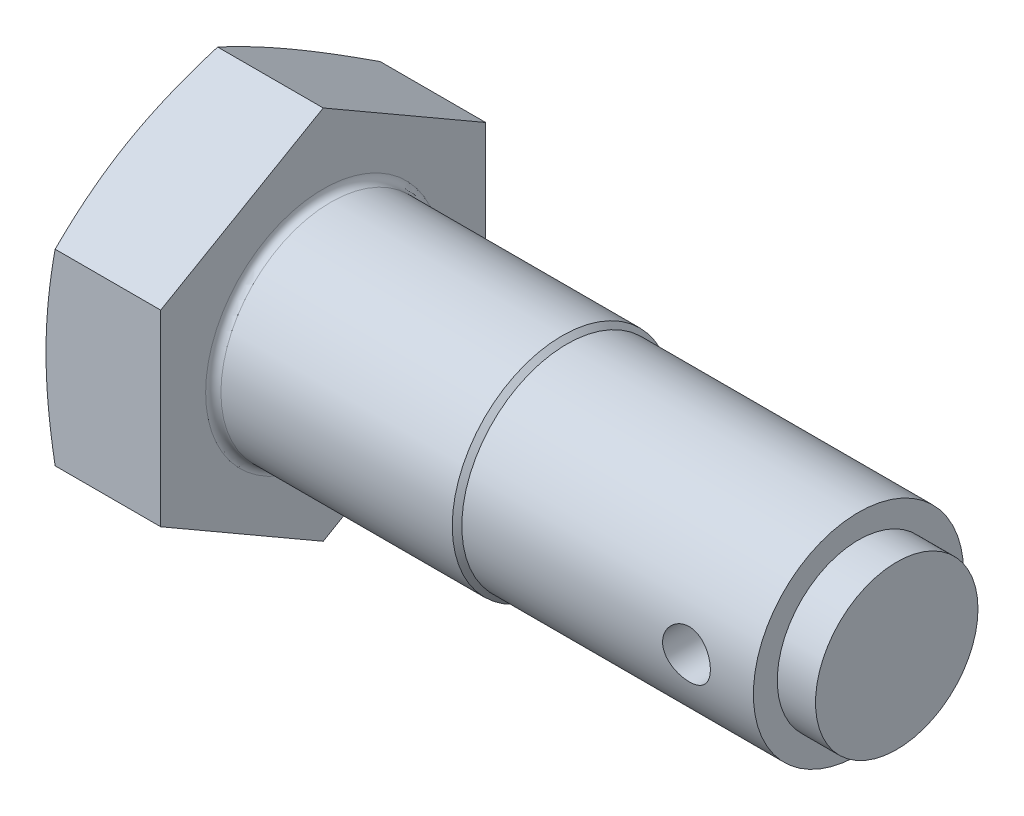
ISO-10303-21;
HEADER;
FILE_DESCRIPTION(('STEP AP214'),'2;1');
FILE_NAME('part.step','',(''),(''),'','','');
FILE_SCHEMA(('AUTOMOTIVE_DESIGN { 1 0 10303 214 1 1 1 1 }'));
ENDSEC;
DATA;
#1=APPLICATION_CONTEXT('core data for automotive mechanical design processes');
#2=APPLICATION_PROTOCOL_DEFINITION('international standard','automotive_design',2000,#1);
#3=PRODUCT_CONTEXT('',#1,'mechanical');
#4=PRODUCT('Part','Part','',(#3));
#5=PRODUCT_RELATED_PRODUCT_CATEGORY('part','',(#4));
#6=PRODUCT_DEFINITION_FORMATION('','',#4);
#7=PRODUCT_DEFINITION_CONTEXT('part definition',#1,'design');
#8=PRODUCT_DEFINITION('design','',#6,#7);
#9=PRODUCT_DEFINITION_SHAPE('','',#8);
#10=(LENGTH_UNIT() NAMED_UNIT(*) SI_UNIT(.MILLI.,.METRE.));
#11=(NAMED_UNIT(*) PLANE_ANGLE_UNIT() SI_UNIT($,.RADIAN.));
#12=(NAMED_UNIT(*) SI_UNIT($,.STERADIAN.) SOLID_ANGLE_UNIT());
#13=UNCERTAINTY_MEASURE_WITH_UNIT(LENGTH_MEASURE(1.E-05),#10,'distance_accuracy_value','');
#14=(GEOMETRIC_REPRESENTATION_CONTEXT(3) GLOBAL_UNCERTAINTY_ASSIGNED_CONTEXT((#13)) GLOBAL_UNIT_ASSIGNED_CONTEXT((#10,
#11,#12)) REPRESENTATION_CONTEXT('',''));
#15=CARTESIAN_POINT('',(0.,0.,0.));
#16=DIRECTION('',(0.,0.,1.));
#17=DIRECTION('',(1.,0.,0.));
#18=AXIS2_PLACEMENT_3D('',#15,#16,#17);
#19=CARTESIAN_POINT('',(12.,-9.81495457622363,17.));
#20=DIRECTION('',(0.,0.866025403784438,-0.5));
#21=DIRECTION('',(0.,0.5,0.866025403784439));
#22=AXIS2_PLACEMENT_3D('',#19,#20,#21);
#23=PLANE('',#22);
#24=CARTESIAN_POINT('',(0.95725067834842,-19.6300246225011,-0.000199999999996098));
#25=CARTESIAN_POINT('',(0.883274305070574,-19.4267620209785,0.351861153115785));
#26=CARTESIAN_POINT('',(0.8126248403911,-19.2232006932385,0.704439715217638));
#27=CARTESIAN_POINT('',(0.678711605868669,-18.8154528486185,1.41067969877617));
#28=CARTESIAN_POINT('',(0.615448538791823,-18.611266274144,1.76434121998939));
#29=CARTESIAN_POINT('',(0.437775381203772,-17.9975024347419,2.82741137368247));
#30=CARTESIAN_POINT('',(0.335585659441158,-17.5870020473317,3.5384189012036));
#31=CARTESIAN_POINT('',(0.211392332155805,-16.9717666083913,4.60403794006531));
#32=CARTESIAN_POINT('',(0.174948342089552,-16.7677413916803,4.95741998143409));
#33=CARTESIAN_POINT('',(0.112012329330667,-16.3593100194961,5.66484386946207));
#34=CARTESIAN_POINT('',(0.0855199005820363,-16.154903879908,6.01888568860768));
#35=CARTESIAN_POINT('',(0.0429497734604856,-15.7458903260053,6.72731794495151));
#36=CARTESIAN_POINT('',(0.0268685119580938,-15.5412830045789,7.08170822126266));
#37=CARTESIAN_POINT('',(0.00539364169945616,-15.1319277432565,7.79073233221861));
#38=CARTESIAN_POINT('',(0.,-14.927179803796,8.14536616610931));
#39=CARTESIAN_POINT('',(0.,-14.5176839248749,8.85463383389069));
#40=CARTESIAN_POINT('',(0.00539364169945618,-14.3129359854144,9.20926766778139));
#41=CARTESIAN_POINT('',(0.0268685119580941,-13.903580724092,9.91829177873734));
#42=CARTESIAN_POINT('',(0.0429497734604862,-13.6989734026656,10.2726820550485));
#43=CARTESIAN_POINT('',(0.0855199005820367,-13.2899598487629,10.9811143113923));
#44=CARTESIAN_POINT('',(0.112012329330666,-13.0855537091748,11.3351561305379));
#45=CARTESIAN_POINT('',(0.174948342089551,-12.6771223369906,12.0425800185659));
#46=CARTESIAN_POINT('',(0.211392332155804,-12.4730971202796,12.3959620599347));
#47=CARTESIAN_POINT('',(0.335585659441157,-11.8578616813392,13.4615810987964));
#48=CARTESIAN_POINT('',(0.437775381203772,-11.447361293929,14.1725886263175));
#49=CARTESIAN_POINT('',(0.615448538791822,-10.8335974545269,15.2356587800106));
#50=CARTESIAN_POINT('',(0.678711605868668,-10.6294108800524,15.5893203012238));
#51=CARTESIAN_POINT('',(0.812624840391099,-10.2216630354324,16.2955602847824));
#52=CARTESIAN_POINT('',(0.883274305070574,-10.0181017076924,16.6481388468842));
#53=CARTESIAN_POINT('',(0.957250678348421,-9.8148391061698,17.0002));
#54=B_SPLINE_CURVE_WITH_KNOTS('',3,(#24,#25,#26,#27,#28,#29,#30,#31,#32,#33,#34,#35,#36,#37,#38,
#39,#40,#41,#42,#43,#44,#45,#46,#47,#48,#49,#50,#51,#52,#53),.UNSPECIFIED.,.F.,.F.,(4,2,2,2,2,2,
2,2,2,2,2,2,2,2,4),(0.,1.23956682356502,2.47925148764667,4.96033455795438,6.18926159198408,
7.41813847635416,8.64659456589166,9.87504686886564,11.1034991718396,12.3319552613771,
13.5608321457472,14.7897591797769,17.2708422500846,18.5105269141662,19.7500937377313),.UNSPECIFIED.);
#55=CARTESIAN_POINT('',(0.957208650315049,-19.6299091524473,0.));
#56=VERTEX_POINT('',#55);
#57=CARTESIAN_POINT('',(0.,-14.7224318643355,8.5));
#58=VERTEX_POINT('',#57);
#59=EDGE_CURVE('E273',#56,#58,#54,.T.);
#60=ORIENTED_EDGE('',*,*,#59,.F.);
#61=DIRECTION('',(-1.,0.,0.));
#62=VECTOR('',#61,1.);
#63=CARTESIAN_POINT('',(12.,-19.6299091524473,0.));
#64=LINE('',#63,#62);
#65=CARTESIAN_POINT('',(12.,-19.6299091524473,0.));
#66=VERTEX_POINT('',#65);
#67=EDGE_CURVE('E151',#66,#56,#64,.T.);
#68=ORIENTED_EDGE('',*,*,#67,.F.);
#69=DIRECTION('',(0.,-0.5,-0.866025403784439));
#70=VECTOR('',#69,1.);
#71=CARTESIAN_POINT('',(12.,-9.81495457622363,17.));
#72=LINE('',#71,#70);
#73=CARTESIAN_POINT('',(12.,-9.81495457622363,17.));
#74=VERTEX_POINT('',#73);
#75=EDGE_CURVE('E283',#74,#66,#72,.T.);
#76=ORIENTED_EDGE('',*,*,#75,.F.);
#77=DIRECTION('',(-1.,0.,0.));
#78=VECTOR('',#77,1.);
#79=CARTESIAN_POINT('',(12.,-9.81495457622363,17.));
#80=LINE('',#79,#78);
#81=CARTESIAN_POINT('',(0.957208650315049,-9.81495457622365,17.));
#82=VERTEX_POINT('',#81);
#83=EDGE_CURVE('E138',#74,#82,#80,.T.);
#84=ORIENTED_EDGE('',*,*,#83,.T.);
#85=EDGE_CURVE('E134',#58,#82,#54,.T.);
#86=ORIENTED_EDGE('',*,*,#85,.F.);
#87=EDGE_LOOP('',(#60,#68,#76,#84,#86));
#88=FACE_BOUND('',#87,.T.);
#89=ADVANCED_FACE('F35',(#88),#23,.F.);
#90=CARTESIAN_POINT('',(12.,-19.6299091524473,0.));
#91=DIRECTION('',(0.,0.866025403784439,0.5));
#92=DIRECTION('',(0.,-0.5,0.866025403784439));
#93=AXIS2_PLACEMENT_3D('',#90,#91,#92);
#94=PLANE('',#93);
#95=CARTESIAN_POINT('',(0.957250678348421,-9.8148391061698,-17.0002));
#96=CARTESIAN_POINT('',(0.883274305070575,-10.0181017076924,-16.6481388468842));
#97=CARTESIAN_POINT('',(0.812624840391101,-10.2216630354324,-16.2955602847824));
#98=CARTESIAN_POINT('',(0.678711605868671,-10.6294108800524,-15.5893203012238));
#99=CARTESIAN_POINT('',(0.615448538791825,-10.8335974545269,-15.2356587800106));
#100=CARTESIAN_POINT('',(0.437775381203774,-11.447361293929,-14.1725886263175));
#101=CARTESIAN_POINT('',(0.335585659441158,-11.8578616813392,-13.4615810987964));
#102=CARTESIAN_POINT('',(0.211392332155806,-12.4730971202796,-12.3959620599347));
#103=CARTESIAN_POINT('',(0.174948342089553,-12.6771223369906,-12.0425800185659));
#104=CARTESIAN_POINT('',(0.112012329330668,-13.0855537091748,-11.3351561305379));
#105=CARTESIAN_POINT('',(0.0855199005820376,-13.2899598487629,-10.9811143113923));
#106=CARTESIAN_POINT('',(0.0429497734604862,-13.6989734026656,-10.2726820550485));
#107=CARTESIAN_POINT('',(0.0268685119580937,-13.903580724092,-9.91829177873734));
#108=CARTESIAN_POINT('',(0.00539364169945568,-14.3129359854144,-9.20926766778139));
#109=CARTESIAN_POINT('',(0.,-14.5176839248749,-8.8546338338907));
#110=CARTESIAN_POINT('',(0.,-14.927179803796,-8.14536616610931));
#111=CARTESIAN_POINT('',(0.00539364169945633,-15.1319277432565,-7.79073233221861));
#112=CARTESIAN_POINT('',(0.026868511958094,-15.5412830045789,-7.08170822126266));
#113=CARTESIAN_POINT('',(0.0429497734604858,-15.7458903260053,-6.72731794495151));
#114=CARTESIAN_POINT('',(0.0855199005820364,-16.154903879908,-6.01888568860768));
#115=CARTESIAN_POINT('',(0.112012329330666,-16.3593100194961,-5.66484386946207));
#116=CARTESIAN_POINT('',(0.174948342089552,-16.7677413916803,-4.95741998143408));
#117=CARTESIAN_POINT('',(0.211392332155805,-16.9717666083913,-4.6040379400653));
#118=CARTESIAN_POINT('',(0.335585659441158,-17.5870020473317,-3.53841890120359));
#119=CARTESIAN_POINT('',(0.437775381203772,-17.9975024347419,-2.82741137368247));
#120=CARTESIAN_POINT('',(0.615448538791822,-18.611266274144,-1.76434121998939));
#121=CARTESIAN_POINT('',(0.678711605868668,-18.8154528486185,-1.41067969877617));
#122=CARTESIAN_POINT('',(0.812624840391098,-19.2232006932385,-0.704439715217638));
#123=CARTESIAN_POINT('',(0.883274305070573,-19.4267620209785,-0.351861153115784));
#124=CARTESIAN_POINT('',(0.957250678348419,-19.6300246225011,0.000199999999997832));
#125=B_SPLINE_CURVE_WITH_KNOTS('',3,(#95,#96,#97,#98,#99,#100,#101,#102,#103,#104,#105,#106,
#107,#108,#109,#110,#111,#112,#113,#114,#115,#116,#117,#118,#119,#120,#121,#122,#123,#124),
.UNSPECIFIED.,.F.,.F.,(4,2,2,2,2,2,2,2,2,2,2,2,2,2,4),(0.,1.23956682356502,2.47925148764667,
4.96033455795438,6.18926159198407,7.41813847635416,8.64659456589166,9.87504686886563,
11.1034991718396,12.3319552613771,13.5608321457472,14.7897591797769,17.2708422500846,
18.5105269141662,19.7500937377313),.UNSPECIFIED.);
#126=CARTESIAN_POINT('',(0.957208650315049,-9.81495457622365,-17.));
#127=VERTEX_POINT('',#126);
#128=CARTESIAN_POINT('',(0.,-14.7224318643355,-8.49999999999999));
#129=VERTEX_POINT('',#128);
#130=EDGE_CURVE('E228',#127,#129,#125,.T.);
#131=ORIENTED_EDGE('',*,*,#130,.F.);
#132=DIRECTION('',(-1.,0.,0.));
#133=VECTOR('',#132,1.);
#134=CARTESIAN_POINT('',(12.,-9.81495457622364,-17.));
#135=LINE('',#134,#133);
#136=CARTESIAN_POINT('',(12.,-9.81495457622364,-17.));
#137=VERTEX_POINT('',#136);
#138=EDGE_CURVE('E148',#137,#127,#135,.T.);
#139=ORIENTED_EDGE('',*,*,#138,.F.);
#140=DIRECTION('',(0.,0.5,-0.866025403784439));
#141=VECTOR('',#140,1.);
#142=CARTESIAN_POINT('',(12.,-19.6299091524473,0.));
#143=LINE('',#142,#141);
#144=EDGE_CURVE('E280',#66,#137,#143,.T.);
#145=ORIENTED_EDGE('',*,*,#144,.F.);
#146=ORIENTED_EDGE('',*,*,#67,.T.);
#147=EDGE_CURVE('E224',#129,#56,#125,.T.);
#148=ORIENTED_EDGE('',*,*,#147,.F.);
#149=EDGE_LOOP('',(#131,#139,#145,#146,#148));
#150=FACE_BOUND('',#149,.T.);
#151=ADVANCED_FACE('F235',(#150),#94,.F.);
#152=CARTESIAN_POINT('',(12.,-9.81495457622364,-17.));
#153=DIRECTION('',(0.,0.,1.));
#154=DIRECTION('',(0.,-1.,0.));
#155=AXIS2_PLACEMENT_3D('',#152,#153,#154);
#156=PLANE('',#155);
#157=CARTESIAN_POINT('',(5.11494433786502,-25.9865515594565,-17.));
#158=CARTESIAN_POINT('',(4.99781404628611,-25.6019864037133,-17.));
#159=CARTESIAN_POINT('',(4.88139210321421,-25.2172056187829,-17.));
#160=CARTESIAN_POINT('',(4.6501234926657,-24.4471686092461,-17.));
#161=CARTESIAN_POINT('',(4.53527683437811,-24.0619123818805,-17.));
#162=CARTESIAN_POINT('',(4.19332284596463,-22.9053140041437,-17.));
#163=CARTESIAN_POINT('',(3.96881886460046,-22.1331989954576,-17.));
#164=CARTESIAN_POINT('',(3.52794140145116,-20.585087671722,-17.));
#165=CARTESIAN_POINT('',(3.31158387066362,-19.8090868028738,-17.));
#166=CARTESIAN_POINT('',(2.88951373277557,-18.2541988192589,-17.));
#167=CARTESIAN_POINT('',(2.6838009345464,-17.4753117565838,-17.));
#168=CARTESIAN_POINT('',(2.28811694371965,-15.923756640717,-17.));
#169=CARTESIAN_POINT('',(2.09798293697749,-15.1511303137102,-17.));
#170=CARTESIAN_POINT('',(1.73390229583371,-13.6020329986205,-17.));
#171=CARTESIAN_POINT('',(1.55995593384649,-12.8255619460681,-17.));
#172=CARTESIAN_POINT('',(1.23230633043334,-11.2686014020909,-17.));
#173=CARTESIAN_POINT('',(1.07859618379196,-10.488113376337,-17.));
#174=CARTESIAN_POINT('',(0.796099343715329,-8.92260605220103,-17.));
#175=CARTESIAN_POINT('',(0.667311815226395,-8.13758690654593,-17.));
#176=CARTESIAN_POINT('',(0.452644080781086,-6.65141371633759,-17.));
#177=CARTESIAN_POINT('',(0.363572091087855,-5.95072503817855,-17.));
#178=CARTESIAN_POINT('',(0.212794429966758,-4.54638482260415,-17.));
#179=CARTESIAN_POINT('',(0.151087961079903,-3.84273337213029,-17.));
#180=CARTESIAN_POINT('',(0.0580129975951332,-2.43389487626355,-17.));
#181=CARTESIAN_POINT('',(0.0266230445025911,-1.72870927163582,-17.));
#182=CARTESIAN_POINT('',(-0.00422961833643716,-0.317632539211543,-17.));
#183=CARTESIAN_POINT('',(-0.00369255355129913,0.388258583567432,-17.));
#184=CARTESIAN_POINT('',(0.0293632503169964,1.80286104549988,-17.));
#185=CARTESIAN_POINT('',(0.0620441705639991,2.51156853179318,-17.));
#186=CARTESIAN_POINT('',(0.157883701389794,3.92690185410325,-17.));
#187=CARTESIAN_POINT('',(0.221043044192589,4.63352763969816,-17.));
#188=CARTESIAN_POINT('',(0.374884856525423,6.04434863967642,-17.));
#189=CARTESIAN_POINT('',(0.465590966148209,6.74854123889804,-17.));
#190=CARTESIAN_POINT('',(0.670847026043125,8.15340353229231,-17.));
#191=CARTESIAN_POINT('',(0.785397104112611,8.85407320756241,-17.));
#192=CARTESIAN_POINT('',(1.04120460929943,10.288760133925,-17.));
#193=CARTESIAN_POINT('',(1.18355422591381,11.022580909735,-17.));
#194=CARTESIAN_POINT('',(1.48657469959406,12.4864541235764,-17.));
#195=CARTESIAN_POINT('',(1.64724693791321,13.2165062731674,-17.));
#196=CARTESIAN_POINT('',(1.98353886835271,14.6733624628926,-17.));
#197=CARTESIAN_POINT('',(2.15916290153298,15.4001654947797,-17.));
#198=CARTESIAN_POINT('',(2.52250153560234,16.8507098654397,-17.));
#199=CARTESIAN_POINT('',(2.71021584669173,17.5744512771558,-17.));
#200=CARTESIAN_POINT('',(3.09572246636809,19.0202310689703,-17.));
#201=CARTESIAN_POINT('',(3.29352740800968,19.7422660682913,-17.));
#202=CARTESIAN_POINT('',(3.69718381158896,21.1840802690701,-17.));
#203=CARTESIAN_POINT('',(3.90303530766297,21.903859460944,-17.));
#204=CARTESIAN_POINT('',(4.32131194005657,23.3413701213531,-17.));
#205=CARTESIAN_POINT('',(4.53373596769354,24.0591019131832,-17.));
#206=CARTESIAN_POINT('',(4.96404894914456,25.4929209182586,-17.));
#207=CARTESIAN_POINT('',(5.18193789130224,26.209008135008,-17.));
#208=CARTESIAN_POINT('',(5.61983797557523,27.6318801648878,-17.));
#209=CARTESIAN_POINT('',(5.83979911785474,28.3386803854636,-17.));
#210=CARTESIAN_POINT('',(6.28347308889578,29.7511031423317,-17.));
#211=CARTESIAN_POINT('',(6.50718592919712,30.4567256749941,-17.));
#212=CARTESIAN_POINT('',(7.18308130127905,32.5721409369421,-17.));
#213=CARTESIAN_POINT('',(7.64000186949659,33.9804205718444,-17.));
#214=CARTESIAN_POINT('',(8.33142797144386,36.0878895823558,-17.));
#215=CARTESIAN_POINT('',(8.56246442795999,36.7882228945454,-17.));
#216=CARTESIAN_POINT('',(9.02653552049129,38.1882282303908,-17.));
#217=CARTESIAN_POINT('',(9.25957015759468,38.8879002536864,-17.));
#218=CARTESIAN_POINT('',(9.72735009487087,40.2866080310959,-17.));
#219=CARTESIAN_POINT('',(9.96209525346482,40.9856438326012,-17.));
#220=CARTESIAN_POINT('',(10.4331045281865,42.3832017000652,-17.));
#221=CARTESIAN_POINT('',(10.6693686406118,43.0817237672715,-17.));
#222=CARTESIAN_POINT('',(10.9062875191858,43.7800232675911,-17.));
#223=B_SPLINE_CURVE_WITH_KNOTS('',3,(#157,#158,#159,#160,#161,#162,#163,#164,#165,#166,#167,
#168,#169,#170,#171,#172,#173,#174,#175,#176,#177,#178,#179,#180,#181,#182,#183,#184,#185,#186,
#187,#188,#189,#190,#191,#192,#193,#194,#195,#196,#197,#198,#199,#200,#201,#202,#203,#204,#205,
#206,#207,#208,#209,#210,#211,#212,#213,#214,#215,#216,#217,#218,#219,#220,#221,#222),
.UNSPECIFIED.,.F.,.F.,(4,2,2,2,2,2,2,2,2,2,2,2,2,2,2,2,2,2,2,2,2,2,2,2,2,2,2,2,2,2,2,2,4),(0.,
1.20602059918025,2.41204823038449,4.82428177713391,7.24101595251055,9.65770671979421,
12.0446009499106,14.4315353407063,16.8176531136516,19.2036909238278,21.3222080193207,
23.4406633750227,25.5576181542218,27.6745579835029,29.8022338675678,31.9299608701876,
34.0595190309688,36.1890886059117,38.4313020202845,40.6736845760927,42.9167204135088,
45.1597025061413,47.4055651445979,49.6514373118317,51.8969326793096,54.1424232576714,
56.3631190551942,58.5838216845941,63.0254177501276,65.2377909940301,67.4501654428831,
69.6623588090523,71.8745467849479),.UNSPECIFIED.);
#224=CARTESIAN_POINT('',(0.957208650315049,9.81495457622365,-17.));
#225=VERTEX_POINT('',#224);
#226=CARTESIAN_POINT('',(0.,0.,-17.));
#227=VERTEX_POINT('',#226);
#228=EDGE_CURVE('E302',#225,#227,#223,.F.);
#229=ORIENTED_EDGE('',*,*,#228,.F.);
#230=DIRECTION('',(-1.,0.,0.));
#231=VECTOR('',#230,1.);
#232=CARTESIAN_POINT('',(12.,9.81495457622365,-17.));
#233=LINE('',#232,#231);
#234=CARTESIAN_POINT('',(12.,9.81495457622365,-17.));
#235=VERTEX_POINT('',#234);
#236=EDGE_CURVE('E140',#235,#225,#233,.T.);
#237=ORIENTED_EDGE('',*,*,#236,.F.);
#238=DIRECTION('',(0.,1.,0.));
#239=VECTOR('',#238,1.);
#240=CARTESIAN_POINT('',(12.,-9.81495457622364,-17.));
#241=LINE('',#240,#239);
#242=EDGE_CURVE('E282',#137,#235,#241,.T.);
#243=ORIENTED_EDGE('',*,*,#242,.F.);
#244=ORIENTED_EDGE('',*,*,#138,.T.);
#245=EDGE_CURVE('E229',#227,#127,#223,.F.);
#246=ORIENTED_EDGE('',*,*,#245,.F.);
#247=EDGE_LOOP('',(#229,#237,#243,#244,#246));
#248=FACE_BOUND('',#247,.T.);
#249=ADVANCED_FACE('F238',(#248),#156,.F.);
#250=CARTESIAN_POINT('',(12.,9.81495457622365,-17.));
#251=DIRECTION('',(0.,-0.866025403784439,0.5));
#252=DIRECTION('',(0.,-0.5,-0.866025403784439));
#253=AXIS2_PLACEMENT_3D('',#250,#251,#252);
#254=PLANE('',#253);
#255=CARTESIAN_POINT('',(0.957250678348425,19.6300246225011,0.000199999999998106));
#256=CARTESIAN_POINT('',(0.883274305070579,19.4267620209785,-0.351861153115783));
#257=CARTESIAN_POINT('',(0.812624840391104,19.2232006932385,-0.704439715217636));
#258=CARTESIAN_POINT('',(0.678711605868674,18.8154528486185,-1.41067969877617));
#259=CARTESIAN_POINT('',(0.615448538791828,18.6112662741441,-1.76434121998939));
#260=CARTESIAN_POINT('',(0.437775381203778,17.9975024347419,-2.82741137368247));
#261=CARTESIAN_POINT('',(0.335585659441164,17.5870020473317,-3.5384189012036));
#262=CARTESIAN_POINT('',(0.21139233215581,16.9717666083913,-4.6040379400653));
#263=CARTESIAN_POINT('',(0.174948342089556,16.7677413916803,-4.95741998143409));
#264=CARTESIAN_POINT('',(0.112012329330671,16.3593100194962,-5.66484386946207));
#265=CARTESIAN_POINT('',(0.0855199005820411,16.1549038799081,-6.01888568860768));
#266=CARTESIAN_POINT('',(0.0429497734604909,15.7458903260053,-6.7273179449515));
#267=CARTESIAN_POINT('',(0.0268685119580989,15.5412830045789,-7.08170822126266));
#268=CARTESIAN_POINT('',(0.00539364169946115,15.1319277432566,-7.79073233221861));
#269=CARTESIAN_POINT('',(0.,14.927179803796,-8.1453661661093));
#270=CARTESIAN_POINT('',(0.,14.5176839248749,-8.85463383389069));
#271=CARTESIAN_POINT('',(0.00539364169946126,14.3129359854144,-9.20926766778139));
#272=CARTESIAN_POINT('',(0.0268685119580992,13.903580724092,-9.91829177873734));
#273=CARTESIAN_POINT('',(0.0429497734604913,13.6989734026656,-10.2726820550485));
#274=CARTESIAN_POINT('',(0.0855199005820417,13.2899598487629,-10.9811143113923));
#275=CARTESIAN_POINT('',(0.112012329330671,13.0855537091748,-11.3351561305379));
#276=CARTESIAN_POINT('',(0.174948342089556,12.6771223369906,-12.0425800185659));
#277=CARTESIAN_POINT('',(0.211392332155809,12.4730971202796,-12.3959620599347));
#278=CARTESIAN_POINT('',(0.335585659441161,11.8578616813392,-13.4615810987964));
#279=CARTESIAN_POINT('',(0.437775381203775,11.447361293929,-14.1725886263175));
#280=CARTESIAN_POINT('',(0.615448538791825,10.8335974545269,-15.2356587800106));
#281=CARTESIAN_POINT('',(0.678711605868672,10.6294108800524,-15.5893203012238));
#282=CARTESIAN_POINT('',(0.812624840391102,10.2216630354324,-16.2955602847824));
#283=CARTESIAN_POINT('',(0.883274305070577,10.0181017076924,-16.6481388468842));
#284=CARTESIAN_POINT('',(0.957250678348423,9.81483910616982,-17.0002));
#285=B_SPLINE_CURVE_WITH_KNOTS('',3,(#255,#256,#257,#258,#259,#260,#261,#262,#263,#264,#265,
#266,#267,#268,#269,#270,#271,#272,#273,#274,#275,#276,#277,#278,#279,#280,#281,#282,#283,#284),
.UNSPECIFIED.,.F.,.F.,(4,2,2,2,2,2,2,2,2,2,2,2,2,2,4),(0.,1.23956682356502,2.47925148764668,
4.96033455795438,6.18926159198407,7.41813847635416,8.64659456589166,9.87504686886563,
11.1034991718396,12.3319552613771,13.5608321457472,14.7897591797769,17.2708422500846,
18.5105269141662,19.7500937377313),.UNSPECIFIED.);
#286=CARTESIAN_POINT('',(0.957208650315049,19.6299091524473,0.));
#287=VERTEX_POINT('',#286);
#288=CARTESIAN_POINT('',(0.,14.7224318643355,-8.5));
#289=VERTEX_POINT('',#288);
#290=EDGE_CURVE('E218',#287,#289,#285,.T.);
#291=ORIENTED_EDGE('',*,*,#290,.F.);
#292=DIRECTION('',(-1.,0.,0.));
#293=VECTOR('',#292,1.);
#294=CARTESIAN_POINT('',(12.,19.6299091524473,0.));
#295=LINE('',#294,#293);
#296=CARTESIAN_POINT('',(12.,19.6299091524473,0.));
#297=VERTEX_POINT('',#296);
#298=EDGE_CURVE('E137',#297,#287,#295,.T.);
#299=ORIENTED_EDGE('',*,*,#298,.F.);
#300=DIRECTION('',(0.,0.5,0.866025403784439));
#301=VECTOR('',#300,1.);
#302=CARTESIAN_POINT('',(12.,9.81495457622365,-17.));
#303=LINE('',#302,#301);
#304=EDGE_CURVE('E291',#235,#297,#303,.T.);
#305=ORIENTED_EDGE('',*,*,#304,.F.);
#306=ORIENTED_EDGE('',*,*,#236,.T.);
#307=EDGE_CURVE('E298',#289,#225,#285,.T.);
#308=ORIENTED_EDGE('',*,*,#307,.F.);
#309=EDGE_LOOP('',(#291,#299,#305,#306,#308));
#310=FACE_BOUND('',#309,.T.);
#311=ADVANCED_FACE('F242',(#310),#254,.F.);
#312=CARTESIAN_POINT('',(12.,19.6299091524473,0.));
#313=DIRECTION('',(0.,-0.866025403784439,-0.5));
#314=DIRECTION('',(0.,0.5,-0.866025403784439));
#315=AXIS2_PLACEMENT_3D('',#312,#313,#314);
#316=PLANE('',#315);
#317=CARTESIAN_POINT('',(0.957250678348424,9.81483910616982,17.0002));
#318=CARTESIAN_POINT('',(0.883274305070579,10.0181017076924,16.6481388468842));
#319=CARTESIAN_POINT('',(0.812624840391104,10.2216630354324,16.2955602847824));
#320=CARTESIAN_POINT('',(0.678711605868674,10.6294108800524,15.5893203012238));
#321=CARTESIAN_POINT('',(0.615448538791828,10.8335974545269,15.2356587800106));
#322=CARTESIAN_POINT('',(0.437775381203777,11.447361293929,14.1725886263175));
#323=CARTESIAN_POINT('',(0.335585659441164,11.8578616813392,13.4615810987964));
#324=CARTESIAN_POINT('',(0.21139233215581,12.4730971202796,12.3959620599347));
#325=CARTESIAN_POINT('',(0.174948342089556,12.6771223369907,12.0425800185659));
#326=CARTESIAN_POINT('',(0.112012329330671,13.0855537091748,11.3351561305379));
#327=CARTESIAN_POINT('',(0.085519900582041,13.2899598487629,10.9811143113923));
#328=CARTESIAN_POINT('',(0.042949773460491,13.6989734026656,10.2726820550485));
#329=CARTESIAN_POINT('',(0.0268685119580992,13.903580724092,9.91829177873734));
#330=CARTESIAN_POINT('',(0.00539364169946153,14.3129359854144,9.20926766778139));
#331=CARTESIAN_POINT('',(0.,14.5176839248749,8.85463383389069));
#332=CARTESIAN_POINT('',(0.,14.927179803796,8.14536616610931));
#333=CARTESIAN_POINT('',(0.00539364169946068,15.1319277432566,7.79073233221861));
#334=CARTESIAN_POINT('',(0.0268685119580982,15.5412830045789,7.08170822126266));
#335=CARTESIAN_POINT('',(0.0429497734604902,15.7458903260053,6.7273179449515));
#336=CARTESIAN_POINT('',(0.0855199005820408,16.1549038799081,6.01888568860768));
#337=CARTESIAN_POINT('',(0.112012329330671,16.3593100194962,5.66484386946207));
#338=CARTESIAN_POINT('',(0.174948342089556,16.7677413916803,4.95741998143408));
#339=CARTESIAN_POINT('',(0.211392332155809,16.9717666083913,4.6040379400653));
#340=CARTESIAN_POINT('',(0.335585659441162,17.5870020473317,3.53841890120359));
#341=CARTESIAN_POINT('',(0.437775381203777,17.9975024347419,2.82741137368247));
#342=CARTESIAN_POINT('',(0.615448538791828,18.6112662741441,1.76434121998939));
#343=CARTESIAN_POINT('',(0.678711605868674,18.8154528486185,1.41067969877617));
#344=CARTESIAN_POINT('',(0.812624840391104,19.2232006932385,0.704439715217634));
#345=CARTESIAN_POINT('',(0.883274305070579,19.4267620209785,0.35186115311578));
#346=CARTESIAN_POINT('',(0.957250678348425,19.6300246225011,-0.00020000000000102));
#347=B_SPLINE_CURVE_WITH_KNOTS('',3,(#317,#318,#319,#320,#321,#322,#323,#324,#325,#326,#327,
#328,#329,#330,#331,#332,#333,#334,#335,#336,#337,#338,#339,#340,#341,#342,#343,#344,#345,#346),
.UNSPECIFIED.,.F.,.F.,(4,2,2,2,2,2,2,2,2,2,2,2,2,2,4),(0.,1.23956682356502,2.47925148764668,
4.96033455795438,6.18926159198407,7.41813847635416,8.64659456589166,9.87504686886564,
11.1034991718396,12.3319552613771,13.5608321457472,14.7897591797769,17.2708422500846,
18.5105269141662,19.7500937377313),.UNSPECIFIED.);
#348=CARTESIAN_POINT('',(0.957208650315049,9.81495457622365,17.));
#349=VERTEX_POINT('',#348);
#350=CARTESIAN_POINT('',(0.,14.7224318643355,8.49999999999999));
#351=VERTEX_POINT('',#350);
#352=EDGE_CURVE('E118',#349,#351,#347,.T.);
#353=ORIENTED_EDGE('',*,*,#352,.F.);
#354=DIRECTION('',(-1.,0.,0.));
#355=VECTOR('',#354,1.);
#356=CARTESIAN_POINT('',(12.,9.81495457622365,17.));
#357=LINE('',#356,#355);
#358=CARTESIAN_POINT('',(12.,9.81495457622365,17.));
#359=VERTEX_POINT('',#358);
#360=EDGE_CURVE('E131',#359,#349,#357,.T.);
#361=ORIENTED_EDGE('',*,*,#360,.F.);
#362=DIRECTION('',(0.,-0.5,0.866025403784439));
#363=VECTOR('',#362,1.);
#364=CARTESIAN_POINT('',(12.,19.6299091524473,0.));
#365=LINE('',#364,#363);
#366=EDGE_CURVE('E293',#297,#359,#365,.T.);
#367=ORIENTED_EDGE('',*,*,#366,.F.);
#368=ORIENTED_EDGE('',*,*,#298,.T.);
#369=EDGE_CURVE('E133',#351,#287,#347,.T.);
#370=ORIENTED_EDGE('',*,*,#369,.F.);
#371=EDGE_LOOP('',(#353,#361,#367,#368,#370));
#372=FACE_BOUND('',#371,.T.);
#373=ADVANCED_FACE('F129',(#372),#316,.F.);
#374=CARTESIAN_POINT('',(12.,9.81495457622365,17.));
#375=DIRECTION('',(0.,0.,-1.));
#376=DIRECTION('',(-1.,0.,0.));
#377=AXIS2_PLACEMENT_3D('',#374,#375,#376);
#378=PLANE('',#377);
#379=CARTESIAN_POINT('',(5.11494341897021,-25.9865485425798,17.));
#380=CARTESIAN_POINT('',(4.99781314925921,-25.6019834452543,17.));
#381=CARTESIAN_POINT('',(4.88139122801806,-25.2172027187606,17.));
#382=CARTESIAN_POINT('',(4.65012266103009,-24.4471658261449,17.));
#383=CARTESIAN_POINT('',(4.53527602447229,-24.0619096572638,17.));
#384=CARTESIAN_POINT('',(4.19332210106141,-22.9053114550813,17.));
#385=CARTESIAN_POINT('',(3.96881816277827,-22.1331965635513,17.));
#386=CARTESIAN_POINT('',(3.52794078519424,-20.5850854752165,17.));
#387=CARTESIAN_POINT('',(3.3115832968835,-19.8090847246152,17.));
#388=CARTESIAN_POINT('',(2.88951324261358,-18.2541969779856,17.));
#389=CARTESIAN_POINT('',(2.68380048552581,-17.4753100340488,17.));
#390=CARTESIAN_POINT('',(2.28811657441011,-15.9237551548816,17.));
#391=CARTESIAN_POINT('',(2.09798260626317,-15.1511289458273,17.));
#392=CARTESIAN_POINT('',(1.73390203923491,-13.6020318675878,17.));
#393=CARTESIAN_POINT('',(1.55995571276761,-12.825560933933,17.));
#394=CARTESIAN_POINT('',(1.23230617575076,-11.2686006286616,17.));
#395=CARTESIAN_POINT('',(1.07859605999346,-10.4881127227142,17.));
#396=CARTESIAN_POINT('',(0.796099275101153,-8.92260563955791,17.));
#397=CARTESIAN_POINT('',(0.667311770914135,-8.13758661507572,17.));
#398=CARTESIAN_POINT('',(0.452644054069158,-6.65141351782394,17.));
#399=CARTESIAN_POINT('',(0.363572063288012,-5.95072481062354,17.));
#400=CARTESIAN_POINT('',(0.212794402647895,-4.54638453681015,17.));
#401=CARTESIAN_POINT('',(0.151087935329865,-3.84273305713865,17.));
#402=CARTESIAN_POINT('',(0.0580129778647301,-2.43389450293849,17.));
#403=CARTESIAN_POINT('',(0.0266230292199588,-1.72870886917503,17.));
#404=CARTESIAN_POINT('',(-0.00422962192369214,-0.317632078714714,17.));
#405=CARTESIAN_POINT('',(-0.00369254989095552,0.388259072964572,17.));
#406=CARTESIAN_POINT('',(0.0293632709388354,1.80286159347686,17.));
#407=CARTESIAN_POINT('',(0.0620442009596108,2.51156910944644,17.));
#408=CARTESIAN_POINT('',(0.157883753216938,3.9269024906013,17.));
#409=CARTESIAN_POINT('',(0.221043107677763,4.6335283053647,17.));
#410=CARTESIAN_POINT('',(0.37488494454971,6.04434936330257,17.));
#411=CARTESIAN_POINT('',(0.465591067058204,6.74854199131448,17.));
#412=CARTESIAN_POINT('',(0.670847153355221,8.1534043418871,17.));
#413=CARTESIAN_POINT('',(0.785397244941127,8.85407404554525,17.));
#414=CARTESIAN_POINT('',(1.04120477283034,10.2887610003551,17.));
#415=CARTESIAN_POINT('',(1.18355439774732,11.0225817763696,17.));
#416=CARTESIAN_POINT('',(1.48657488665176,12.4864549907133,17.));
#417=CARTESIAN_POINT('',(1.64724713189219,13.2165071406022,17.));
#418=CARTESIAN_POINT('',(1.98353907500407,14.6733633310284,17.));
#419=CARTESIAN_POINT('',(2.15916311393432,15.4001663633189,17.));
#420=CARTESIAN_POINT('',(2.52250175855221,16.8507107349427,17.));
#421=CARTESIAN_POINT('',(2.71021607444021,17.5744521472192,17.));
#422=CARTESIAN_POINT('',(3.09572270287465,19.0202319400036,17.));
#423=CARTESIAN_POINT('',(3.29352764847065,19.7422669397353,17.));
#424=CARTESIAN_POINT('',(3.69718405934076,21.1840811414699,17.));
#425=CARTESIAN_POINT('',(3.90303555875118,21.903860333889,17.));
#426=CARTESIAN_POINT('',(4.32131219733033,23.341370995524,17.));
#427=CARTESIAN_POINT('',(4.53373622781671,24.0591027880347,17.));
#428=CARTESIAN_POINT('',(4.96404921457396,25.4929217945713,17.));
#429=CARTESIAN_POINT('',(5.18193815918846,26.2090090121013,17.));
#430=CARTESIAN_POINT('',(5.61983824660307,27.6318810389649,17.));
#431=CARTESIAN_POINT('',(5.83979938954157,28.338681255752,17.));
#432=CARTESIAN_POINT('',(6.28347336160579,29.7511040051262,17.));
#433=CARTESIAN_POINT('',(6.50718620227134,30.4567265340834,17.));
#434=CARTESIAN_POINT('',(7.18308157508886,32.5721417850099,17.));
#435=CARTESIAN_POINT('',(7.64000214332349,33.9804214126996,17.));
#436=CARTESIAN_POINT('',(8.33142824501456,36.0878904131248,17.));
#437=CARTESIAN_POINT('',(8.56246470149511,36.788223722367,17.));
#438=CARTESIAN_POINT('',(9.02653579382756,38.1882290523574,17.));
#439=CARTESIAN_POINT('',(9.25957043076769,38.8879010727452,17.));
#440=CARTESIAN_POINT('',(9.72735036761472,40.2866088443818,17.));
#441=CARTESIAN_POINT('',(9.96209552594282,40.9856446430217,17.));
#442=CARTESIAN_POINT('',(10.4331048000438,42.3832025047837,17.));
#443=CARTESIAN_POINT('',(10.6693689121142,43.0817245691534,17.));
#444=CARTESIAN_POINT('',(10.906287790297,43.7800240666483,17.));
#445=B_SPLINE_CURVE_WITH_KNOTS('',3,(#379,#380,#381,#382,#383,#384,#385,#386,#387,#388,#389,
#390,#391,#392,#393,#394,#395,#396,#397,#398,#399,#400,#401,#402,#403,#404,#405,#406,#407,#408,
#409,#410,#411,#412,#413,#414,#415,#416,#417,#418,#419,#420,#421,#422,#423,#424,#425,#426,#427,
#428,#429,#430,#431,#432,#433,#434,#435,#436,#437,#438,#439,#440,#441,#442,#443,#444),
.UNSPECIFIED.,.F.,.F.,(4,2,2,2,2,2,2,2,2,2,2,2,2,2,2,2,2,2,2,2,2,2,2,2,2,2,2,2,2,2,2,2,4),(0.,
1.20602041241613,2.41204785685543,4.82428103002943,7.24101482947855,9.65770522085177,
12.0445990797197,14.4315330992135,16.8176505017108,19.203687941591,21.3222051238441,
23.4406605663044,25.5576154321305,27.6745553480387,29.8022313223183,31.9299584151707,
34.0595166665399,36.1890863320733,38.4312997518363,40.6736823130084,42.9167181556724,
45.1597002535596,47.4055628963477,49.6514350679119,51.8969304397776,54.1424210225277,
56.3631168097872,58.5838194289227,63.0254154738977,65.2377887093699,67.4501631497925,
69.6623565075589,71.8745444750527),.UNSPECIFIED.);
#446=CARTESIAN_POINT('',(0.,0.,17.));
#447=VERTEX_POINT('',#446);
#448=EDGE_CURVE('E124',#82,#447,#445,.T.);
#449=ORIENTED_EDGE('',*,*,#448,.F.);
#450=ORIENTED_EDGE('',*,*,#83,.F.);
#451=DIRECTION('',(0.,-1.,0.));
#452=VECTOR('',#451,1.);
#453=CARTESIAN_POINT('',(12.,9.81495457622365,17.));
#454=LINE('',#453,#452);
#455=EDGE_CURVE('E64',#359,#74,#454,.T.);
#456=ORIENTED_EDGE('',*,*,#455,.F.);
#457=ORIENTED_EDGE('',*,*,#360,.T.);
#458=EDGE_CURVE('E115',#447,#349,#445,.T.);
#459=ORIENTED_EDGE('',*,*,#458,.F.);
#460=EDGE_LOOP('',(#449,#450,#456,#457,#459));
#461=FACE_BOUND('',#460,.T.);
#462=ADVANCED_FACE('F136',(#461),#378,.F.);
#463=CARTESIAN_POINT('',(163.112698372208,0.,0.));
#464=DIRECTION('',(-1.,0.,0.));
#465=DIRECTION('',(0.,0.,1.));
#466=AXIS2_PLACEMENT_3D('',#463,#464,#465);
#467=CYLINDRICAL_SURFACE('',#466,11.);
#468=CARTESIAN_POINT('',(63.5,0.,11.));
#469=CARTESIAN_POINT('',(63.4999954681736,-0.138518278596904,10.9999974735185));
#470=CARTESIAN_POINT('',(63.4884487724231,-0.277090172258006,10.9973570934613));
#471=CARTESIAN_POINT('',(63.4426205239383,-0.550288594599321,10.987079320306));
#472=CARTESIAN_POINT('',(63.4083236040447,-0.684912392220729,10.9794385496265));
#473=CARTESIAN_POINT('',(63.3181319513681,-0.946227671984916,10.9600095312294));
#474=CARTESIAN_POINT('',(63.2622606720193,-1.07292759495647,10.9482257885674));
#475=CARTESIAN_POINT('',(63.1305828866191,-1.31515227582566,10.921778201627));
#476=CARTESIAN_POINT('',(63.0547765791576,-1.43067714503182,10.9071143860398));
#477=CARTESIAN_POINT('',(62.8839979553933,-1.64926760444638,10.8762265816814));
#478=CARTESIAN_POINT('',(62.788747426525,-1.75211293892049,10.8599819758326));
#479=CARTESIAN_POINT('',(62.5823810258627,-1.9405138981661,10.827906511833));
#480=CARTESIAN_POINT('',(62.4712636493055,-2.02606788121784,10.8120756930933));
#481=CARTESIAN_POINT('',(62.2346679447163,-2.17844599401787,10.7824158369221));
#482=CARTESIAN_POINT('',(62.1090330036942,-2.24503254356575,10.7686131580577));
#483=CARTESIAN_POINT('',(61.8479904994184,-2.35606069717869,10.7448696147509));
#484=CARTESIAN_POINT('',(61.7125842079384,-2.40050517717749,10.7349282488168));
#485=CARTESIAN_POINT('',(61.4382408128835,-2.46525349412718,10.7202434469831));
#486=CARTESIAN_POINT('',(61.2994007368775,-2.48594892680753,10.715415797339));
#487=CARTESIAN_POINT('',(61.0201417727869,-2.50382988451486,10.7112523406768));
#488=CARTESIAN_POINT('',(60.8797230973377,-2.50101853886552,10.711915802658));
#489=CARTESIAN_POINT('',(60.6042271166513,-2.47228016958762,10.7185835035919));
#490=CARTESIAN_POINT('',(60.4690990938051,-2.44681104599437,10.7244819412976));
#491=CARTESIAN_POINT('',(60.2050855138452,-2.37420684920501,10.7407873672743));
#492=CARTESIAN_POINT('',(60.0762003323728,-2.32707047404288,10.7511946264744));
#493=CARTESIAN_POINT('',(59.8270593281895,-2.21205734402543,10.7754474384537));
#494=CARTESIAN_POINT('',(59.7068864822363,-2.14400712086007,10.7893215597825));
#495=CARTESIAN_POINT('',(59.4794974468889,-1.98921977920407,10.8189276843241));
#496=CARTESIAN_POINT('',(59.3722831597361,-1.90247992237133,10.8346599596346));
#497=CARTESIAN_POINT('',(59.171221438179,-1.71036518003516,10.8666615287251));
#498=CARTESIAN_POINT('',(59.0777455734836,-1.60460166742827,10.882934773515));
#499=CARTESIAN_POINT('',(58.9097941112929,-1.37871229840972,10.9138502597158));
#500=CARTESIAN_POINT('',(58.8353189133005,-1.25858614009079,10.9284924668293));
#501=CARTESIAN_POINT('',(58.7073796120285,-1.00690799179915,10.9545497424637));
#502=CARTESIAN_POINT('',(58.6539672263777,-0.87532883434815,10.9659568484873));
#503=CARTESIAN_POINT('',(58.5701159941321,-0.604745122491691,10.9841998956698));
#504=CARTESIAN_POINT('',(58.5396735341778,-0.465741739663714,10.9910365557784));
#505=CARTESIAN_POINT('',(58.5031737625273,-0.187439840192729,10.9992650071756));
#506=CARTESIAN_POINT('',(58.4966093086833,-0.048211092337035,11.0007700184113));
#507=CARTESIAN_POINT('',(58.5066730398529,0.229353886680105,10.9984842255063));
#508=CARTESIAN_POINT('',(58.523299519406,0.367690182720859,10.9946938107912));
#509=CARTESIAN_POINT('',(58.5788531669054,0.63784167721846,10.9823148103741));
#510=CARTESIAN_POINT('',(58.6175115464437,0.769715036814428,10.973784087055));
#511=CARTESIAN_POINT('',(58.7157310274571,1.02510393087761,10.9528806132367));
#512=CARTESIAN_POINT('',(58.7752940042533,1.14861871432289,10.9405075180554));
#513=CARTESIAN_POINT('',(58.9146691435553,1.38586085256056,10.9130143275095));
#514=CARTESIAN_POINT('',(58.9947756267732,1.49941068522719,10.8978552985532));
#515=CARTESIAN_POINT('',(59.1725793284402,1.71163773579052,10.866546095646));
#516=CARTESIAN_POINT('',(59.2702790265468,1.81031285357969,10.8503957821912));
#517=CARTESIAN_POINT('',(59.4828309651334,1.99201706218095,10.8185287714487));
#518=CARTESIAN_POINT('',(59.5979872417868,2.07469366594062,10.8028272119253));
#519=CARTESIAN_POINT('',(59.8408463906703,2.21953814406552,10.7740023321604));
#520=CARTESIAN_POINT('',(59.9685487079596,2.28170692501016,10.7608788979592));
#521=CARTESIAN_POINT('',(60.2321804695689,2.38333597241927,10.7388274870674));
#522=CARTESIAN_POINT('',(60.3680573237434,2.42292716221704,10.7298753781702));
#523=CARTESIAN_POINT('',(60.6447669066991,2.47865258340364,10.7171411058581));
#524=CARTESIAN_POINT('',(60.7855987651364,2.49479091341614,10.7133580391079));
#525=CARTESIAN_POINT('',(61.0646586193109,2.50296739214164,10.7114502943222));
#526=CARTESIAN_POINT('',(61.2028695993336,2.4955654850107,10.7131941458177));
#527=CARTESIAN_POINT('',(61.4760189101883,2.45813115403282,10.7218446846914));
#528=CARTESIAN_POINT('',(61.6109572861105,2.42809904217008,10.7287513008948));
#529=CARTESIAN_POINT('',(61.8732433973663,2.34653692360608,10.7468826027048));
#530=CARTESIAN_POINT('',(62.0006196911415,2.29509457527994,10.758089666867));
#531=CARTESIAN_POINT('',(62.2450147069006,2.1722453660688,10.783564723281));
#532=CARTESIAN_POINT('',(62.3620322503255,2.10083623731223,10.7978330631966));
#533=CARTESIAN_POINT('',(62.5851344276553,1.93824996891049,10.828211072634));
#534=CARTESIAN_POINT('',(62.6909257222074,1.84667645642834,10.8443540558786));
#535=CARTESIAN_POINT('',(62.8858231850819,1.64715628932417,10.8764454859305));
#536=CARTESIAN_POINT('',(62.974925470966,1.53920583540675,10.8923938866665));
#537=CARTESIAN_POINT('',(63.1351380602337,1.30814060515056,10.9225693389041));
#538=CARTESIAN_POINT('',(63.2059738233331,1.18483162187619,10.9367686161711));
#539=CARTESIAN_POINT('',(63.325799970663,0.927755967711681,10.9615640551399));
#540=CARTESIAN_POINT('',(63.3748079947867,0.793997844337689,10.9721631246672));
#541=CARTESIAN_POINT('',(63.4412279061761,0.550163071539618,10.9867559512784));
#542=CARTESIAN_POINT('',(63.4632239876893,0.441368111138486,10.9916908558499));
#543=CARTESIAN_POINT('',(63.4926114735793,0.221726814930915,10.9983138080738));
#544=CARTESIAN_POINT('',(63.5000036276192,0.1108805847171,11.0000020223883));
#545=CARTESIAN_POINT('',(63.5,0.,11.));
#546=B_SPLINE_CURVE_WITH_KNOTS('',3,(#468,#469,#470,#471,#472,#473,#474,#475,#476,#477,#478,
#479,#480,#481,#482,#483,#484,#485,#486,#487,#488,#489,#490,#491,#492,#493,#494,#495,#496,#497,
#498,#499,#500,#501,#502,#503,#504,#505,#506,#507,#508,#509,#510,#511,#512,#513,#514,#515,#516,
#517,#518,#519,#520,#521,#522,#523,#524,#525,#526,#527,#528,#529,#530,#531,#532,#533,#534,#535,
#536,#537,#538,#539,#540,#541,#542,#543,#544,#545),.UNSPECIFIED.,.T.,.F.,(4,2,2,2,2,2,2,2,2,2,2,
2,2,2,2,2,2,2,2,2,2,2,2,2,2,2,2,2,2,2,2,2,2,2,2,2,2,2,4),(0.,0.415148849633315,
0.830578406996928,1.24555761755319,1.66053269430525,2.08192389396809,2.50335508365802,
2.92985362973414,3.35629676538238,3.77560244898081,4.19485231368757,4.60581714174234,
5.0168066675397,5.43130157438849,5.84585725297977,6.27011531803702,6.69438230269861,
7.11968464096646,7.54492006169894,7.9610694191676,8.37718817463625,8.78833576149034,
9.19952024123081,9.61696129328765,10.0344612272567,10.4603132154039,10.8861463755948,
11.3094844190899,11.732748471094,12.1460204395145,12.5592867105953,12.9708773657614,
13.382514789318,13.8031102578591,14.2238034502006,14.6504927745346,15.0768366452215,
15.4091704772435,15.74148724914),.UNSPECIFIED.);
#547=CARTESIAN_POINT('',(63.5,0.,11.));
#548=VERTEX_POINT('',#547);
#549=EDGE_CURVE('E39',#548,#548,#546,.T.);
#550=ORIENTED_EDGE('',*,*,#549,.T.);
#551=EDGE_LOOP('',(#550));
#552=FACE_BOUND('',#551,.T.);
#553=CARTESIAN_POINT('',(63.5,0.,-11.));
#554=CARTESIAN_POINT('',(63.4999954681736,0.138518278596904,-10.9999974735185));
#555=CARTESIAN_POINT('',(63.4884487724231,0.277090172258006,-10.9973570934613));
#556=CARTESIAN_POINT('',(63.4426205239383,0.550288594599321,-10.987079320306));
#557=CARTESIAN_POINT('',(63.4083236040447,0.684912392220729,-10.9794385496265));
#558=CARTESIAN_POINT('',(63.3181319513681,0.946227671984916,-10.9600095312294));
#559=CARTESIAN_POINT('',(63.2622606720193,1.07292759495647,-10.9482257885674));
#560=CARTESIAN_POINT('',(63.1305828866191,1.31515227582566,-10.921778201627));
#561=CARTESIAN_POINT('',(63.0547765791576,1.43067714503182,-10.9071143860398));
#562=CARTESIAN_POINT('',(62.8839979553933,1.64926760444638,-10.8762265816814));
#563=CARTESIAN_POINT('',(62.788747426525,1.75211293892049,-10.8599819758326));
#564=CARTESIAN_POINT('',(62.5823810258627,1.9405138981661,-10.827906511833));
#565=CARTESIAN_POINT('',(62.4712636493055,2.02606788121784,-10.8120756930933));
#566=CARTESIAN_POINT('',(62.2346679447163,2.17844599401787,-10.7824158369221));
#567=CARTESIAN_POINT('',(62.1090330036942,2.24503254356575,-10.7686131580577));
#568=CARTESIAN_POINT('',(61.8479904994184,2.35606069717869,-10.7448696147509));
#569=CARTESIAN_POINT('',(61.7125842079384,2.40050517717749,-10.7349282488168));
#570=CARTESIAN_POINT('',(61.4382408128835,2.46525349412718,-10.7202434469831));
#571=CARTESIAN_POINT('',(61.2994007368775,2.48594892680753,-10.715415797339));
#572=CARTESIAN_POINT('',(61.0201417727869,2.50382988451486,-10.7112523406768));
#573=CARTESIAN_POINT('',(60.8797230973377,2.50101853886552,-10.711915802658));
#574=CARTESIAN_POINT('',(60.6042271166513,2.47228016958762,-10.7185835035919));
#575=CARTESIAN_POINT('',(60.4690990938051,2.44681104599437,-10.7244819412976));
#576=CARTESIAN_POINT('',(60.2050855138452,2.37420684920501,-10.7407873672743));
#577=CARTESIAN_POINT('',(60.0762003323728,2.32707047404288,-10.7511946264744));
#578=CARTESIAN_POINT('',(59.8270593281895,2.21205734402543,-10.7754474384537));
#579=CARTESIAN_POINT('',(59.7068864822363,2.14400712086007,-10.7893215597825));
#580=CARTESIAN_POINT('',(59.4794974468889,1.98921977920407,-10.8189276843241));
#581=CARTESIAN_POINT('',(59.3722831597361,1.90247992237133,-10.8346599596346));
#582=CARTESIAN_POINT('',(59.171221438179,1.71036518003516,-10.8666615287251));
#583=CARTESIAN_POINT('',(59.0777455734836,1.60460166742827,-10.882934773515));
#584=CARTESIAN_POINT('',(58.9097941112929,1.37871229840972,-10.9138502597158));
#585=CARTESIAN_POINT('',(58.8353189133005,1.25858614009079,-10.9284924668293));
#586=CARTESIAN_POINT('',(58.7073796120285,1.00690799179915,-10.9545497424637));
#587=CARTESIAN_POINT('',(58.6539672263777,0.87532883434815,-10.9659568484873));
#588=CARTESIAN_POINT('',(58.5701159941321,0.604745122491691,-10.9841998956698));
#589=CARTESIAN_POINT('',(58.5396735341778,0.465741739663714,-10.9910365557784));
#590=CARTESIAN_POINT('',(58.5031737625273,0.187439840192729,-10.9992650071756));
#591=CARTESIAN_POINT('',(58.4966093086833,0.048211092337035,-11.0007700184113));
#592=CARTESIAN_POINT('',(58.5066730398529,-0.229353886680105,-10.9984842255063));
#593=CARTESIAN_POINT('',(58.523299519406,-0.367690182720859,-10.9946938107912));
#594=CARTESIAN_POINT('',(58.5788531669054,-0.63784167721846,-10.9823148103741));
#595=CARTESIAN_POINT('',(58.6175115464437,-0.769715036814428,-10.973784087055));
#596=CARTESIAN_POINT('',(58.7157310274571,-1.02510393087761,-10.9528806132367));
#597=CARTESIAN_POINT('',(58.7752940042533,-1.14861871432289,-10.9405075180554));
#598=CARTESIAN_POINT('',(58.9146691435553,-1.38586085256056,-10.9130143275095));
#599=CARTESIAN_POINT('',(58.9947756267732,-1.49941068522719,-10.8978552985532));
#600=CARTESIAN_POINT('',(59.1725793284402,-1.71163773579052,-10.866546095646));
#601=CARTESIAN_POINT('',(59.2702790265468,-1.81031285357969,-10.8503957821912));
#602=CARTESIAN_POINT('',(59.4828309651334,-1.99201706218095,-10.8185287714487));
#603=CARTESIAN_POINT('',(59.5979872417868,-2.07469366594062,-10.8028272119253));
#604=CARTESIAN_POINT('',(59.8408463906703,-2.21953814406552,-10.7740023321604));
#605=CARTESIAN_POINT('',(59.9685487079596,-2.28170692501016,-10.7608788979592));
#606=CARTESIAN_POINT('',(60.2321804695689,-2.38333597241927,-10.7388274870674));
#607=CARTESIAN_POINT('',(60.3680573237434,-2.42292716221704,-10.7298753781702));
#608=CARTESIAN_POINT('',(60.6447669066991,-2.47865258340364,-10.7171411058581));
#609=CARTESIAN_POINT('',(60.7855987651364,-2.49479091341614,-10.7133580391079));
#610=CARTESIAN_POINT('',(61.0646586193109,-2.50296739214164,-10.7114502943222));
#611=CARTESIAN_POINT('',(61.2028695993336,-2.4955654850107,-10.7131941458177));
#612=CARTESIAN_POINT('',(61.4760189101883,-2.45813115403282,-10.7218446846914));
#613=CARTESIAN_POINT('',(61.6109572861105,-2.42809904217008,-10.7287513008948));
#614=CARTESIAN_POINT('',(61.8732433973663,-2.34653692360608,-10.7468826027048));
#615=CARTESIAN_POINT('',(62.0006196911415,-2.29509457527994,-10.758089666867));
#616=CARTESIAN_POINT('',(62.2450147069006,-2.1722453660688,-10.783564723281));
#617=CARTESIAN_POINT('',(62.3620322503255,-2.10083623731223,-10.7978330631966));
#618=CARTESIAN_POINT('',(62.5851344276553,-1.93824996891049,-10.828211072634));
#619=CARTESIAN_POINT('',(62.6909257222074,-1.84667645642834,-10.8443540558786));
#620=CARTESIAN_POINT('',(62.8858231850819,-1.64715628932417,-10.8764454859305));
#621=CARTESIAN_POINT('',(62.974925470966,-1.53920583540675,-10.8923938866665));
#622=CARTESIAN_POINT('',(63.1351380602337,-1.30814060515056,-10.9225693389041));
#623=CARTESIAN_POINT('',(63.2059738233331,-1.18483162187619,-10.9367686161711));
#624=CARTESIAN_POINT('',(63.325799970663,-0.927755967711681,-10.9615640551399));
#625=CARTESIAN_POINT('',(63.3748079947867,-0.793997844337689,-10.9721631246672));
#626=CARTESIAN_POINT('',(63.4412279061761,-0.550163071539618,-10.9867559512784));
#627=CARTESIAN_POINT('',(63.4632239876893,-0.441368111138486,-10.9916908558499));
#628=CARTESIAN_POINT('',(63.4926114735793,-0.221726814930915,-10.9983138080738));
#629=CARTESIAN_POINT('',(63.5000036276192,-0.1108805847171,-11.0000020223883));
#630=CARTESIAN_POINT('',(63.5,0.,-11.));
#631=B_SPLINE_CURVE_WITH_KNOTS('',3,(#553,#554,#555,#556,#557,#558,#559,#560,#561,#562,#563,
#564,#565,#566,#567,#568,#569,#570,#571,#572,#573,#574,#575,#576,#577,#578,#579,#580,#581,#582,
#583,#584,#585,#586,#587,#588,#589,#590,#591,#592,#593,#594,#595,#596,#597,#598,#599,#600,#601,
#602,#603,#604,#605,#606,#607,#608,#609,#610,#611,#612,#613,#614,#615,#616,#617,#618,#619,#620,
#621,#622,#623,#624,#625,#626,#627,#628,#629,#630),.UNSPECIFIED.,.T.,.F.,(4,2,2,2,2,2,2,2,2,2,2,
2,2,2,2,2,2,2,2,2,2,2,2,2,2,2,2,2,2,2,2,2,2,2,2,2,2,2,4),(0.,0.415148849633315,
0.830578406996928,1.24555761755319,1.66053269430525,2.08192389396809,2.50335508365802,
2.92985362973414,3.35629676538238,3.77560244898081,4.19485231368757,4.60581714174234,
5.0168066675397,5.43130157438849,5.84585725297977,6.27011531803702,6.69438230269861,
7.11968464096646,7.54492006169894,7.9610694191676,8.37718817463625,8.78833576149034,
9.19952024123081,9.61696129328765,10.0344612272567,10.4603132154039,10.8861463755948,
11.3094844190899,11.732748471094,12.1460204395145,12.5592867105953,12.9708773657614,
13.382514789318,13.8031102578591,14.2238034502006,14.6504927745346,15.0768366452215,
15.4091704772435,15.74148724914),.UNSPECIFIED.);
#632=CARTESIAN_POINT('',(63.5,0.,-11.));
#633=VERTEX_POINT('',#632);
#634=EDGE_CURVE('E166',#633,#633,#631,.T.);
#635=ORIENTED_EDGE('',*,*,#634,.T.);
#636=EDGE_LOOP('',(#635));
#637=FACE_BOUND('',#636,.T.);
#638=CARTESIAN_POINT('',(37.5,0.,0.));
#639=DIRECTION('',(1.,0.,0.));
#640=DIRECTION('',(0.,0.,-1.));
#641=AXIS2_PLACEMENT_3D('',#638,#639,#640);
#642=CIRCLE('',#641,11.);
#643=CARTESIAN_POINT('',(37.5,0.,-11.));
#644=VERTEX_POINT('',#643);
#645=EDGE_CURVE('E13',#644,#644,#642,.T.);
#646=ORIENTED_EDGE('',*,*,#645,.T.);
#647=EDGE_LOOP('',(#646));
#648=FACE_BOUND('',#647,.T.);
#649=CARTESIAN_POINT('',(68.,0.,0.));
#650=DIRECTION('',(1.,0.,0.));
#651=DIRECTION('',(0.,0.,-1.));
#652=AXIS2_PLACEMENT_3D('',#649,#650,#651);
#653=CIRCLE('',#652,11.);
#654=CARTESIAN_POINT('',(68.,0.,-11.));
#655=VERTEX_POINT('',#654);
#656=EDGE_CURVE('E154',#655,#655,#653,.T.);
#657=ORIENTED_EDGE('',*,*,#656,.F.);
#658=EDGE_LOOP('',(#657));
#659=FACE_BOUND('',#658,.T.);
#660=ADVANCED_FACE('F170',(#552,#637,#648,#659),#467,.T.);
#661=CARTESIAN_POINT('',(12.,-9.81495457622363,17.));
#662=DIRECTION('',(-1.,0.,0.));
#663=DIRECTION('',(0.,0.,1.));
#664=AXIS2_PLACEMENT_3D('',#661,#662,#663);
#665=PLANE('',#664);
#666=CARTESIAN_POINT('',(12.,0.,0.));
#667=DIRECTION('',(-1.,0.,0.));
#668=DIRECTION('',(0.,0.,1.));
#669=AXIS2_PLACEMENT_3D('',#666,#667,#668);
#670=CIRCLE('',#669,12.3);
#671=CARTESIAN_POINT('',(12.,0.,12.3));
#672=VERTEX_POINT('',#671);
#673=EDGE_CURVE('E48',#672,#672,#670,.T.);
#674=ORIENTED_EDGE('',*,*,#673,.T.);
#675=EDGE_LOOP('',(#674));
#676=FACE_BOUND('',#675,.T.);
#677=ORIENTED_EDGE('',*,*,#75,.T.);
#678=ORIENTED_EDGE('',*,*,#144,.T.);
#679=ORIENTED_EDGE('',*,*,#242,.T.);
#680=ORIENTED_EDGE('',*,*,#304,.T.);
#681=ORIENTED_EDGE('',*,*,#366,.T.);
#682=ORIENTED_EDGE('',*,*,#455,.T.);
#683=EDGE_LOOP('',(#677,#678,#679,#680,#681,#682));
#684=FACE_BOUND('',#683,.T.);
#685=ADVANCED_FACE('F252',(#676,#684),#665,.F.);
#686=CARTESIAN_POINT('',(37.,0.,0.));
#687=DIRECTION('',(-1.,0.,0.));
#688=DIRECTION('',(0.,0.,1.));
#689=AXIS2_PLACEMENT_3D('',#686,#687,#688);
#690=CYLINDRICAL_SURFACE('',#689,11.5);
#691=CARTESIAN_POINT('',(12.8,0.,0.));
#692=DIRECTION('',(-1.,0.,0.));
#693=DIRECTION('',(0.,0.,1.));
#694=AXIS2_PLACEMENT_3D('',#691,#692,#693);
#695=CIRCLE('',#694,11.5);
#696=CARTESIAN_POINT('',(12.8,0.,11.5));
#697=VERTEX_POINT('',#696);
#698=EDGE_CURVE('E162',#697,#697,#695,.F.);
#699=ORIENTED_EDGE('',*,*,#698,.T.);
#700=EDGE_LOOP('',(#699));
#701=FACE_BOUND('',#700,.T.);
#702=CARTESIAN_POINT('',(37.,0.,0.));
#703=DIRECTION('',(1.,0.,0.));
#704=DIRECTION('',(0.,0.,-1.));
#705=AXIS2_PLACEMENT_3D('',#702,#703,#704);
#706=CIRCLE('',#705,11.5);
#707=CARTESIAN_POINT('',(37.,0.,-11.5));
#708=VERTEX_POINT('',#707);
#709=EDGE_CURVE('E157',#708,#708,#706,.T.);
#710=ORIENTED_EDGE('',*,*,#709,.F.);
#711=EDGE_LOOP('',(#710));
#712=FACE_BOUND('',#711,.T.);
#713=ADVANCED_FACE('F255',(#701,#712),#690,.T.);
#714=CARTESIAN_POINT('',(68.,0.,0.));
#715=DIRECTION('',(1.,0.,0.));
#716=DIRECTION('',(0.,0.,-1.));
#717=AXIS2_PLACEMENT_3D('',#714,#715,#716);
#718=PLANE('',#717);
#719=CARTESIAN_POINT('',(68.,0.,0.));
#720=DIRECTION('',(1.,0.,0.));
#721=DIRECTION('',(0.,0.,-1.));
#722=AXIS2_PLACEMENT_3D('',#719,#720,#721);
#723=CIRCLE('',#722,8.5);
#724=CARTESIAN_POINT('',(68.,0.,-8.5));
#725=VERTEX_POINT('',#724);
#726=EDGE_CURVE('E158',#725,#725,#723,.T.);
#727=ORIENTED_EDGE('',*,*,#726,.F.);
#728=EDGE_LOOP('',(#727));
#729=FACE_BOUND('',#728,.T.);
#730=ORIENTED_EDGE('',*,*,#656,.T.);
#731=EDGE_LOOP('',(#730));
#732=FACE_BOUND('',#731,.T.);
#733=ADVANCED_FACE('F259',(#729,#732),#718,.T.);
#734=CARTESIAN_POINT('',(68.,0.,0.));
#735=DIRECTION('',(1.,0.,0.));
#736=DIRECTION('',(0.,0.,-1.));
#737=AXIS2_PLACEMENT_3D('',#734,#735,#736);
#738=CYLINDRICAL_SURFACE('',#737,8.5);
#739=ORIENTED_EDGE('',*,*,#726,.T.);
#740=EDGE_LOOP('',(#739));
#741=FACE_BOUND('',#740,.T.);
#742=CARTESIAN_POINT('',(72.,0.,0.));
#743=DIRECTION('',(1.,0.,0.));
#744=DIRECTION('',(0.,0.,-1.));
#745=AXIS2_PLACEMENT_3D('',#742,#743,#744);
#746=CIRCLE('',#745,8.5);
#747=CARTESIAN_POINT('',(72.,0.,-8.5));
#748=VERTEX_POINT('',#747);
#749=EDGE_CURVE('E441',#748,#748,#746,.T.);
#750=ORIENTED_EDGE('',*,*,#749,.F.);
#751=EDGE_LOOP('',(#750));
#752=FACE_BOUND('',#751,.T.);
#753=ADVANCED_FACE('F196',(#741,#752),#738,.T.);
#754=CARTESIAN_POINT('',(72.,-9.81495457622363,17.));
#755=DIRECTION('',(-1.,0.,0.));
#756=DIRECTION('',(0.,0.,1.));
#757=AXIS2_PLACEMENT_3D('',#754,#755,#756);
#758=PLANE('',#757);
#759=ORIENTED_EDGE('',*,*,#749,.T.);
#760=EDGE_LOOP('',(#759));
#761=FACE_BOUND('',#760,.T.);
#762=ADVANCED_FACE('F318',(#761),#758,.F.);
#763=CARTESIAN_POINT('',(0.,0.,0.));
#764=DIRECTION('',(1.,0.,0.));
#765=DIRECTION('',(0.,0.,-1.));
#766=AXIS2_PLACEMENT_3D('',#763,#764,#765);
#767=CONICAL_SURFACE('',#766,17.,1.22173047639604);
#768=ORIENTED_EDGE('',*,*,#85,.T.);
#769=ORIENTED_EDGE('',*,*,#448,.T.);
#770=CARTESIAN_POINT('',(0.,0.,0.));
#771=DIRECTION('',(-1.,0.,0.));
#772=DIRECTION('',(0.,0.,1.));
#773=AXIS2_PLACEMENT_3D('',#770,#771,#772);
#774=CIRCLE('',#773,17.);
#775=EDGE_CURVE('E56',#58,#447,#774,.T.);
#776=ORIENTED_EDGE('',*,*,#775,.F.);
#777=EDGE_LOOP('',(#768,#769,#776));
#778=FACE_BOUND('',#777,.T.);
#779=ADVANCED_FACE('F313',(#778),#767,.T.);
#780=ORIENTED_EDGE('',*,*,#147,.T.);
#781=ORIENTED_EDGE('',*,*,#59,.T.);
#782=EDGE_CURVE('E160',#129,#58,#774,.T.);
#783=ORIENTED_EDGE('',*,*,#782,.F.);
#784=EDGE_LOOP('',(#780,#781,#783));
#785=FACE_BOUND('',#784,.T.);
#786=ADVANCED_FACE('F309',(#785),#767,.T.);
#787=ORIENTED_EDGE('',*,*,#245,.T.);
#788=ORIENTED_EDGE('',*,*,#130,.T.);
#789=EDGE_CURVE('E306',#227,#129,#774,.T.);
#790=ORIENTED_EDGE('',*,*,#789,.F.);
#791=EDGE_LOOP('',(#787,#788,#790));
#792=FACE_BOUND('',#791,.T.);
#793=ADVANCED_FACE('F194',(#792),#767,.T.);
#794=ORIENTED_EDGE('',*,*,#228,.T.);
#795=EDGE_CURVE('E311',#289,#227,#774,.T.);
#796=ORIENTED_EDGE('',*,*,#795,.F.);
#797=ORIENTED_EDGE('',*,*,#307,.T.);
#798=EDGE_LOOP('',(#794,#796,#797));
#799=FACE_BOUND('',#798,.T.);
#800=ADVANCED_FACE('F189',(#799),#767,.T.);
#801=ORIENTED_EDGE('',*,*,#290,.T.);
#802=EDGE_CURVE('E161',#351,#289,#774,.T.);
#803=ORIENTED_EDGE('',*,*,#802,.F.);
#804=ORIENTED_EDGE('',*,*,#369,.T.);
#805=EDGE_LOOP('',(#801,#803,#804));
#806=FACE_BOUND('',#805,.T.);
#807=ADVANCED_FACE('F193',(#806),#767,.T.);
#808=ORIENTED_EDGE('',*,*,#352,.T.);
#809=CARTESIAN_POINT('',(0.,0.,0.));
#810=DIRECTION('',(-1.,0.,0.));
#811=DIRECTION('',(0.,0.,1.));
#812=AXIS2_PLACEMENT_3D('',#809,#810,#811);
#813=CIRCLE('',#812,17.);
#814=EDGE_CURVE('E120',#447,#351,#813,.T.);
#815=ORIENTED_EDGE('',*,*,#814,.F.);
#816=ORIENTED_EDGE('',*,*,#458,.T.);
#817=EDGE_LOOP('',(#808,#815,#816));
#818=FACE_BOUND('',#817,.T.);
#819=ADVANCED_FACE('F117',(#818),#767,.T.);
#820=CARTESIAN_POINT('',(0.,-9.81495457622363,17.));
#821=DIRECTION('',(-1.,0.,0.));
#822=DIRECTION('',(0.,0.,1.));
#823=AXIS2_PLACEMENT_3D('',#820,#821,#822);
#824=PLANE('',#823);
#825=ORIENTED_EDGE('',*,*,#775,.T.);
#826=ORIENTED_EDGE('',*,*,#814,.T.);
#827=ORIENTED_EDGE('',*,*,#802,.T.);
#828=ORIENTED_EDGE('',*,*,#795,.T.);
#829=ORIENTED_EDGE('',*,*,#789,.T.);
#830=ORIENTED_EDGE('',*,*,#782,.T.);
#831=EDGE_LOOP('',(#825,#826,#827,#828,#829,#830));
#832=FACE_BOUND('',#831,.T.);
#833=ADVANCED_FACE('F187',(#832),#824,.T.);
#834=CARTESIAN_POINT('',(12.8,0.,0.));
#835=DIRECTION('',(-1.,0.,0.));
#836=DIRECTION('',(0.,0.,1.));
#837=AXIS2_PLACEMENT_3D('',#834,#835,#836);
#838=TOROIDAL_SURFACE('',#837,12.3,0.8);
#839=ORIENTED_EDGE('',*,*,#673,.F.);
#840=EDGE_LOOP('',(#839));
#841=FACE_BOUND('',#840,.T.);
#842=ORIENTED_EDGE('',*,*,#698,.F.);
#843=EDGE_LOOP('',(#842));
#844=FACE_BOUND('',#843,.T.);
#845=ADVANCED_FACE('F183',(#841,#844),#838,.F.);
#846=CARTESIAN_POINT('',(37.5,0.,0.));
#847=DIRECTION('',(-1.,0.,0.));
#848=DIRECTION('',(0.,0.,1.));
#849=AXIS2_PLACEMENT_3D('',#846,#847,#848);
#850=CONICAL_SURFACE('',#849,11.,0.785398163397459);
#851=ORIENTED_EDGE('',*,*,#709,.T.);
#852=EDGE_LOOP('',(#851));
#853=FACE_BOUND('',#852,.T.);
#854=ORIENTED_EDGE('',*,*,#645,.F.);
#855=EDGE_LOOP('',(#854));
#856=FACE_BOUND('',#855,.T.);
#857=ADVANCED_FACE('F178',(#853,#856),#850,.T.);
#858=CARTESIAN_POINT('',(61.,0.,-17.));
#859=DIRECTION('',(0.,0.,1.));
#860=DIRECTION('',(1.,0.,0.));
#861=AXIS2_PLACEMENT_3D('',#858,#859,#860);
#862=CYLINDRICAL_SURFACE('',#861,2.5);
#863=ORIENTED_EDGE('',*,*,#634,.F.);
#864=EDGE_LOOP('',(#863));
#865=FACE_BOUND('',#864,.T.);
#866=ORIENTED_EDGE('',*,*,#549,.F.);
#867=EDGE_LOOP('',(#866));
#868=FACE_BOUND('',#867,.T.);
#869=ADVANCED_FACE('F174',(#865,#868),#862,.F.);
#870=CLOSED_SHELL('',(#89,#151,#249,#311,#373,#462,#660,#685,#713,#733,#753,#762,#779,#786,#793,
#800,#807,#819,#833,#845,#857,#869));
#871=MANIFOLD_SOLID_BREP('B2',#870);
#872=ADVANCED_BREP_SHAPE_REPRESENTATION('',(#18,#871),#14);
#873=SHAPE_DEFINITION_REPRESENTATION(#9,#872);
ENDSEC;
END-ISO-10303-21;
